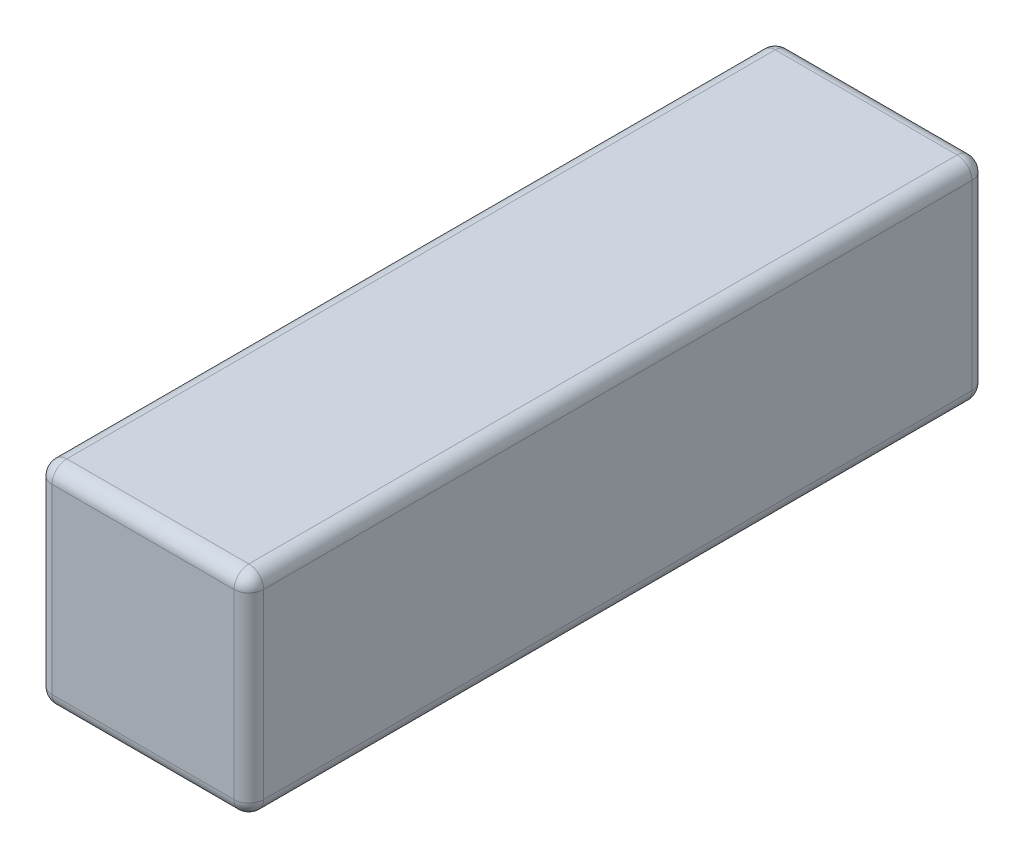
ISO-10303-21;
HEADER;
FILE_DESCRIPTION(('STEP AP214'),'2;1');
FILE_NAME('part.step','',(''),(''),'','','');
FILE_SCHEMA(('AUTOMOTIVE_DESIGN { 1 0 10303 214 1 1 1 1 }'));
ENDSEC;
DATA;
#1=APPLICATION_CONTEXT('core data for automotive mechanical design processes');
#2=APPLICATION_PROTOCOL_DEFINITION('international standard','automotive_design',2000,#1);
#3=PRODUCT_CONTEXT('',#1,'mechanical');
#4=PRODUCT('Part','Part','',(#3));
#5=PRODUCT_RELATED_PRODUCT_CATEGORY('part','',(#4));
#6=PRODUCT_DEFINITION_FORMATION('','',#4);
#7=PRODUCT_DEFINITION_CONTEXT('part definition',#1,'design');
#8=PRODUCT_DEFINITION('design','',#6,#7);
#9=PRODUCT_DEFINITION_SHAPE('','',#8);
#10=(LENGTH_UNIT() NAMED_UNIT(*) SI_UNIT(.MILLI.,.METRE.));
#11=(NAMED_UNIT(*) PLANE_ANGLE_UNIT() SI_UNIT($,.RADIAN.));
#12=(NAMED_UNIT(*) SI_UNIT($,.STERADIAN.) SOLID_ANGLE_UNIT());
#13=UNCERTAINTY_MEASURE_WITH_UNIT(LENGTH_MEASURE(1.E-05),#10,'distance_accuracy_value','');
#14=(GEOMETRIC_REPRESENTATION_CONTEXT(3) GLOBAL_UNCERTAINTY_ASSIGNED_CONTEXT((#13)) GLOBAL_UNIT_ASSIGNED_CONTEXT((#10,
#11,#12)) REPRESENTATION_CONTEXT('',''));
#15=CARTESIAN_POINT('',(0.,0.,0.));
#16=DIRECTION('',(0.,0.,1.));
#17=DIRECTION('',(1.,0.,0.));
#18=AXIS2_PLACEMENT_3D('',#15,#16,#17);
#19=CARTESIAN_POINT('',(-18.5,21.5,72.));
#20=DIRECTION('',(0.,-1.,0.));
#21=DIRECTION('',(0.,0.,-1.));
#22=AXIS2_PLACEMENT_3D('',#19,#20,#21);
#23=CYLINDRICAL_SURFACE('',#22,3.);
#24=DIRECTION('',(0.,-1.,0.));
#25=VECTOR('',#24,1.);
#26=CARTESIAN_POINT('',(-21.5,21.5,72.));
#27=LINE('',#26,#25);
#28=CARTESIAN_POINT('',(-21.5,18.5,72.));
#29=VERTEX_POINT('',#28);
#30=CARTESIAN_POINT('',(-21.5,-18.5,72.));
#31=VERTEX_POINT('',#30);
#32=EDGE_CURVE('E241',#29,#31,#27,.T.);
#33=ORIENTED_EDGE('',*,*,#32,.T.);
#34=CARTESIAN_POINT('',(-18.5,-18.5,72.));
#35=DIRECTION('',(0.,-1.,0.));
#36=DIRECTION('',(0.,0.,-1.));
#37=AXIS2_PLACEMENT_3D('',#34,#35,#36);
#38=CIRCLE('',#37,3.);
#39=CARTESIAN_POINT('',(-18.5,-18.5,75.));
#40=VERTEX_POINT('',#39);
#41=EDGE_CURVE('E296',#31,#40,#38,.F.);
#42=ORIENTED_EDGE('',*,*,#41,.T.);
#43=DIRECTION('',(0.,-1.,0.));
#44=VECTOR('',#43,1.);
#45=CARTESIAN_POINT('',(-18.5,21.5,75.));
#46=LINE('',#45,#44);
#47=CARTESIAN_POINT('',(-18.5,18.5,75.));
#48=VERTEX_POINT('',#47);
#49=EDGE_CURVE('E170',#48,#40,#46,.T.);
#50=ORIENTED_EDGE('',*,*,#49,.F.);
#51=CARTESIAN_POINT('',(-18.5,18.5,72.));
#52=DIRECTION('',(0.,-1.,0.));
#53=DIRECTION('',(0.,0.,-1.));
#54=AXIS2_PLACEMENT_3D('',#51,#52,#53);
#55=CIRCLE('',#54,3.);
#56=EDGE_CURVE('E293',#48,#29,#55,.T.);
#57=ORIENTED_EDGE('',*,*,#56,.T.);
#58=EDGE_LOOP('',(#33,#42,#50,#57));
#59=FACE_BOUND('',#58,.T.);
#60=ADVANCED_FACE('F46',(#59),#23,.T.);
#61=CARTESIAN_POINT('',(-18.5,21.5,75.));
#62=DIRECTION('',(0.,0.,-1.));
#63=DIRECTION('',(-1.,0.,0.));
#64=AXIS2_PLACEMENT_3D('',#61,#62,#63);
#65=PLANE('',#64);
#66=ORIENTED_EDGE('',*,*,#49,.T.);
#67=DIRECTION('',(1.,0.,0.));
#68=VECTOR('',#67,1.);
#69=CARTESIAN_POINT('',(-18.5,-18.5,75.));
#70=LINE('',#69,#68);
#71=CARTESIAN_POINT('',(18.5,-18.5,75.));
#72=VERTEX_POINT('',#71);
#73=EDGE_CURVE('E277',#40,#72,#70,.T.);
#74=ORIENTED_EDGE('',*,*,#73,.T.);
#75=DIRECTION('',(0.,-1.,0.));
#76=VECTOR('',#75,1.);
#77=CARTESIAN_POINT('',(18.5,21.5,75.));
#78=LINE('',#77,#76);
#79=CARTESIAN_POINT('',(18.5,18.5,75.));
#80=VERTEX_POINT('',#79);
#81=EDGE_CURVE('E161',#80,#72,#78,.T.);
#82=ORIENTED_EDGE('',*,*,#81,.F.);
#83=DIRECTION('',(1.,0.,0.));
#84=VECTOR('',#83,1.);
#85=CARTESIAN_POINT('',(-18.5,18.5,75.));
#86=LINE('',#85,#84);
#87=EDGE_CURVE('E274',#80,#48,#86,.F.);
#88=ORIENTED_EDGE('',*,*,#87,.T.);
#89=EDGE_LOOP('',(#66,#74,#82,#88));
#90=FACE_BOUND('',#89,.T.);
#91=ADVANCED_FACE('F337',(#90),#65,.F.);
#92=CARTESIAN_POINT('',(18.5,21.5,72.));
#93=DIRECTION('',(0.,-1.,0.));
#94=DIRECTION('',(0.,0.,-1.));
#95=AXIS2_PLACEMENT_3D('',#92,#93,#94);
#96=CYLINDRICAL_SURFACE('',#95,3.);
#97=ORIENTED_EDGE('',*,*,#81,.T.);
#98=CARTESIAN_POINT('',(18.5,-18.5,72.));
#99=DIRECTION('',(0.,-1.,0.));
#100=DIRECTION('',(0.,0.,-1.));
#101=AXIS2_PLACEMENT_3D('',#98,#99,#100);
#102=CIRCLE('',#101,3.);
#103=CARTESIAN_POINT('',(21.5,-18.5,72.));
#104=VERTEX_POINT('',#103);
#105=EDGE_CURVE('E159',#72,#104,#102,.F.);
#106=ORIENTED_EDGE('',*,*,#105,.T.);
#107=DIRECTION('',(0.,-1.,0.));
#108=VECTOR('',#107,1.);
#109=CARTESIAN_POINT('',(21.5,21.5,72.));
#110=LINE('',#109,#108);
#111=CARTESIAN_POINT('',(21.5,18.5,72.));
#112=VERTEX_POINT('',#111);
#113=EDGE_CURVE('E140',#112,#104,#110,.T.);
#114=ORIENTED_EDGE('',*,*,#113,.F.);
#115=CARTESIAN_POINT('',(18.5,18.5,72.));
#116=DIRECTION('',(0.,-1.,0.));
#117=DIRECTION('',(0.,0.,-1.));
#118=AXIS2_PLACEMENT_3D('',#115,#116,#117);
#119=CIRCLE('',#118,3.);
#120=EDGE_CURVE('E156',#112,#80,#119,.T.);
#121=ORIENTED_EDGE('',*,*,#120,.T.);
#122=EDGE_LOOP('',(#97,#106,#114,#121));
#123=FACE_BOUND('',#122,.T.);
#124=ADVANCED_FACE('F155',(#123),#96,.T.);
#125=CARTESIAN_POINT('',(21.5,21.5,72.));
#126=DIRECTION('',(-1.,0.,0.));
#127=DIRECTION('',(0.,0.,1.));
#128=AXIS2_PLACEMENT_3D('',#125,#126,#127);
#129=PLANE('',#128);
#130=ORIENTED_EDGE('',*,*,#113,.T.);
#131=DIRECTION('',(0.,0.,-1.));
#132=VECTOR('',#131,1.);
#133=CARTESIAN_POINT('',(21.5,-18.5,72.));
#134=LINE('',#133,#132);
#135=CARTESIAN_POINT('',(21.5,-18.5,-72.));
#136=VERTEX_POINT('',#135);
#137=EDGE_CURVE('E11',#104,#136,#134,.T.);
#138=ORIENTED_EDGE('',*,*,#137,.T.);
#139=DIRECTION('',(0.,-1.,0.));
#140=VECTOR('',#139,1.);
#141=CARTESIAN_POINT('',(21.5,21.5,-72.));
#142=LINE('',#141,#140);
#143=CARTESIAN_POINT('',(21.5,18.5,-72.));
#144=VERTEX_POINT('',#143);
#145=EDGE_CURVE('E142',#144,#136,#142,.T.);
#146=ORIENTED_EDGE('',*,*,#145,.F.);
#147=DIRECTION('',(0.,0.,-1.));
#148=VECTOR('',#147,1.);
#149=CARTESIAN_POINT('',(21.5,18.5,72.));
#150=LINE('',#149,#148);
#151=EDGE_CURVE('E56',#144,#112,#150,.F.);
#152=ORIENTED_EDGE('',*,*,#151,.T.);
#153=EDGE_LOOP('',(#130,#138,#146,#152));
#154=FACE_BOUND('',#153,.T.);
#155=ADVANCED_FACE('F139',(#154),#129,.F.);
#156=CARTESIAN_POINT('',(18.5,21.5,-72.));
#157=DIRECTION('',(0.,-1.,0.));
#158=DIRECTION('',(0.,0.,-1.));
#159=AXIS2_PLACEMENT_3D('',#156,#157,#158);
#160=CYLINDRICAL_SURFACE('',#159,3.);
#161=ORIENTED_EDGE('',*,*,#145,.T.);
#162=CARTESIAN_POINT('',(18.5,-18.5,-72.));
#163=DIRECTION('',(0.,-1.,0.));
#164=DIRECTION('',(0.,0.,-1.));
#165=AXIS2_PLACEMENT_3D('',#162,#163,#164);
#166=CIRCLE('',#165,3.);
#167=CARTESIAN_POINT('',(18.5,-18.5,-75.));
#168=VERTEX_POINT('',#167);
#169=EDGE_CURVE('E320',#136,#168,#166,.F.);
#170=ORIENTED_EDGE('',*,*,#169,.T.);
#171=DIRECTION('',(0.,-1.,0.));
#172=VECTOR('',#171,1.);
#173=CARTESIAN_POINT('',(18.5,21.5,-75.));
#174=LINE('',#173,#172);
#175=CARTESIAN_POINT('',(18.5,18.5,-75.));
#176=VERTEX_POINT('',#175);
#177=EDGE_CURVE('E261',#176,#168,#174,.T.);
#178=ORIENTED_EDGE('',*,*,#177,.F.);
#179=CARTESIAN_POINT('',(18.5,18.5,-72.));
#180=DIRECTION('',(0.,-1.,0.));
#181=DIRECTION('',(0.,0.,-1.));
#182=AXIS2_PLACEMENT_3D('',#179,#180,#181);
#183=CIRCLE('',#182,3.);
#184=EDGE_CURVE('E317',#176,#144,#183,.T.);
#185=ORIENTED_EDGE('',*,*,#184,.T.);
#186=EDGE_LOOP('',(#161,#170,#178,#185));
#187=FACE_BOUND('',#186,.T.);
#188=ADVANCED_FACE('F360',(#187),#160,.T.);
#189=CARTESIAN_POINT('',(-18.5,21.5,-75.));
#190=DIRECTION('',(0.,0.,1.));
#191=DIRECTION('',(1.,0.,0.));
#192=AXIS2_PLACEMENT_3D('',#189,#190,#191);
#193=PLANE('',#192);
#194=ORIENTED_EDGE('',*,*,#177,.T.);
#195=DIRECTION('',(-1.,0.,0.));
#196=VECTOR('',#195,1.);
#197=CARTESIAN_POINT('',(-18.5,-18.5,-75.));
#198=LINE('',#197,#196);
#199=CARTESIAN_POINT('',(-18.5,-18.5,-75.));
#200=VERTEX_POINT('',#199);
#201=EDGE_CURVE('E314',#168,#200,#198,.T.);
#202=ORIENTED_EDGE('',*,*,#201,.T.);
#203=DIRECTION('',(0.,-1.,0.));
#204=VECTOR('',#203,1.);
#205=CARTESIAN_POINT('',(-18.5,21.5,-75.));
#206=LINE('',#205,#204);
#207=CARTESIAN_POINT('',(-18.5,18.5,-75.));
#208=VERTEX_POINT('',#207);
#209=EDGE_CURVE('E255',#208,#200,#206,.T.);
#210=ORIENTED_EDGE('',*,*,#209,.F.);
#211=DIRECTION('',(-1.,0.,0.));
#212=VECTOR('',#211,1.);
#213=CARTESIAN_POINT('',(18.5,18.5,-75.));
#214=LINE('',#213,#212);
#215=EDGE_CURVE('E311',#208,#176,#214,.F.);
#216=ORIENTED_EDGE('',*,*,#215,.T.);
#217=EDGE_LOOP('',(#194,#202,#210,#216));
#218=FACE_BOUND('',#217,.T.);
#219=ADVANCED_FACE('F358',(#218),#193,.F.);
#220=CARTESIAN_POINT('',(-18.5,21.5,-72.));
#221=DIRECTION('',(0.,-1.,0.));
#222=DIRECTION('',(0.,0.,-1.));
#223=AXIS2_PLACEMENT_3D('',#220,#221,#222);
#224=CYLINDRICAL_SURFACE('',#223,3.);
#225=ORIENTED_EDGE('',*,*,#209,.T.);
#226=CARTESIAN_POINT('',(-18.5,-18.5,-72.));
#227=DIRECTION('',(0.,-1.,0.));
#228=DIRECTION('',(0.,0.,-1.));
#229=AXIS2_PLACEMENT_3D('',#226,#227,#228);
#230=CIRCLE('',#229,3.);
#231=CARTESIAN_POINT('',(-21.5,-18.5,-72.));
#232=VERTEX_POINT('',#231);
#233=EDGE_CURVE('E308',#200,#232,#230,.F.);
#234=ORIENTED_EDGE('',*,*,#233,.T.);
#235=DIRECTION('',(0.,-1.,0.));
#236=VECTOR('',#235,1.);
#237=CARTESIAN_POINT('',(-21.5,21.5,-72.));
#238=LINE('',#237,#236);
#239=CARTESIAN_POINT('',(-21.5,18.5,-72.));
#240=VERTEX_POINT('',#239);
#241=EDGE_CURVE('E248',#240,#232,#238,.T.);
#242=ORIENTED_EDGE('',*,*,#241,.F.);
#243=CARTESIAN_POINT('',(-18.5,18.5,-72.));
#244=DIRECTION('',(0.,-1.,0.));
#245=DIRECTION('',(0.,0.,-1.));
#246=AXIS2_PLACEMENT_3D('',#243,#244,#245);
#247=CIRCLE('',#246,3.);
#248=EDGE_CURVE('E305',#240,#208,#247,.T.);
#249=ORIENTED_EDGE('',*,*,#248,.T.);
#250=EDGE_LOOP('',(#225,#234,#242,#249));
#251=FACE_BOUND('',#250,.T.);
#252=ADVANCED_FACE('F349',(#251),#224,.T.);
#253=CARTESIAN_POINT('',(-21.5,21.5,72.));
#254=DIRECTION('',(1.,0.,0.));
#255=DIRECTION('',(0.,0.,-1.));
#256=AXIS2_PLACEMENT_3D('',#253,#254,#255);
#257=PLANE('',#256);
#258=ORIENTED_EDGE('',*,*,#241,.T.);
#259=DIRECTION('',(0.,0.,1.));
#260=VECTOR('',#259,1.);
#261=CARTESIAN_POINT('',(-21.5,-18.5,72.));
#262=LINE('',#261,#260);
#263=EDGE_CURVE('E302',#232,#31,#262,.T.);
#264=ORIENTED_EDGE('',*,*,#263,.T.);
#265=ORIENTED_EDGE('',*,*,#32,.F.);
#266=DIRECTION('',(0.,0.,1.));
#267=VECTOR('',#266,1.);
#268=CARTESIAN_POINT('',(-21.5,18.5,-72.));
#269=LINE('',#268,#267);
#270=EDGE_CURVE('E299',#29,#240,#269,.F.);
#271=ORIENTED_EDGE('',*,*,#270,.T.);
#272=EDGE_LOOP('',(#258,#264,#265,#271));
#273=FACE_BOUND('',#272,.T.);
#274=ADVANCED_FACE('F346',(#273),#257,.F.);
#275=CARTESIAN_POINT('',(-18.5,21.5,72.));
#276=DIRECTION('',(0.,1.,0.));
#277=DIRECTION('',(0.,0.,1.));
#278=AXIS2_PLACEMENT_3D('',#275,#276,#277);
#279=PLANE('',#278);
#280=DIRECTION('',(0.,0.,1.));
#281=VECTOR('',#280,1.);
#282=CARTESIAN_POINT('',(-18.5,21.5,72.));
#283=LINE('',#282,#281);
#284=CARTESIAN_POINT('',(-18.5,21.5,-72.));
#285=VERTEX_POINT('',#284);
#286=CARTESIAN_POINT('',(-18.5,21.5,72.));
#287=VERTEX_POINT('',#286);
#288=EDGE_CURVE('E64',#285,#287,#283,.T.);
#289=ORIENTED_EDGE('',*,*,#288,.T.);
#290=DIRECTION('',(1.,0.,0.));
#291=VECTOR('',#290,1.);
#292=CARTESIAN_POINT('',(18.5,21.5,72.));
#293=LINE('',#292,#291);
#294=CARTESIAN_POINT('',(18.5,21.5,72.));
#295=VERTEX_POINT('',#294);
#296=EDGE_CURVE('E148',#287,#295,#293,.T.);
#297=ORIENTED_EDGE('',*,*,#296,.T.);
#298=DIRECTION('',(0.,0.,-1.));
#299=VECTOR('',#298,1.);
#300=CARTESIAN_POINT('',(18.5,21.5,-72.));
#301=LINE('',#300,#299);
#302=CARTESIAN_POINT('',(18.5,21.5,-72.));
#303=VERTEX_POINT('',#302);
#304=EDGE_CURVE('E174',#295,#303,#301,.T.);
#305=ORIENTED_EDGE('',*,*,#304,.T.);
#306=DIRECTION('',(-1.,0.,0.));
#307=VECTOR('',#306,1.);
#308=CARTESIAN_POINT('',(-18.5,21.5,-72.));
#309=LINE('',#308,#307);
#310=EDGE_CURVE('E69',#303,#285,#309,.T.);
#311=ORIENTED_EDGE('',*,*,#310,.T.);
#312=EDGE_LOOP('',(#289,#297,#305,#311));
#313=FACE_BOUND('',#312,.T.);
#314=ADVANCED_FACE('F331',(#313),#279,.T.);
#315=CARTESIAN_POINT('',(-18.5,-21.5,72.));
#316=DIRECTION('',(0.,1.,0.));
#317=DIRECTION('',(0.,0.,1.));
#318=AXIS2_PLACEMENT_3D('',#315,#316,#317);
#319=PLANE('',#318);
#320=DIRECTION('',(0.,0.,-1.));
#321=VECTOR('',#320,1.);
#322=CARTESIAN_POINT('',(18.5,-21.5,72.));
#323=LINE('',#322,#321);
#324=CARTESIAN_POINT('',(18.5,-21.5,-72.));
#325=VERTEX_POINT('',#324);
#326=CARTESIAN_POINT('',(18.5,-21.5,72.));
#327=VERTEX_POINT('',#326);
#328=EDGE_CURVE('E280',#325,#327,#323,.F.);
#329=ORIENTED_EDGE('',*,*,#328,.T.);
#330=DIRECTION('',(1.,0.,0.));
#331=VECTOR('',#330,1.);
#332=CARTESIAN_POINT('',(-18.5,-21.5,72.));
#333=LINE('',#332,#331);
#334=CARTESIAN_POINT('',(-18.5,-21.5,72.));
#335=VERTEX_POINT('',#334);
#336=EDGE_CURVE('E289',#327,#335,#333,.F.);
#337=ORIENTED_EDGE('',*,*,#336,.T.);
#338=DIRECTION('',(0.,0.,1.));
#339=VECTOR('',#338,1.);
#340=CARTESIAN_POINT('',(-18.5,-21.5,72.));
#341=LINE('',#340,#339);
#342=CARTESIAN_POINT('',(-18.5,-21.5,-72.));
#343=VERTEX_POINT('',#342);
#344=EDGE_CURVE('E286',#335,#343,#341,.F.);
#345=ORIENTED_EDGE('',*,*,#344,.T.);
#346=DIRECTION('',(-1.,0.,0.));
#347=VECTOR('',#346,1.);
#348=CARTESIAN_POINT('',(-18.5,-21.5,-72.));
#349=LINE('',#348,#347);
#350=EDGE_CURVE('E283',#343,#325,#349,.F.);
#351=ORIENTED_EDGE('',*,*,#350,.T.);
#352=EDGE_LOOP('',(#329,#337,#345,#351));
#353=FACE_BOUND('',#352,.T.);
#354=ADVANCED_FACE('F371',(#353),#319,.F.);
#355=CARTESIAN_POINT('',(-18.5,-18.5,-72.));
#356=DIRECTION('',(0.,1.,0.));
#357=DIRECTION('',(0.,0.,1.));
#358=AXIS2_PLACEMENT_3D('',#355,#356,#357);
#359=SPHERICAL_SURFACE('',#358,3.);
#360=CARTESIAN_POINT('',(-18.5,-18.5,-72.));
#361=DIRECTION('',(1.,0.,0.));
#362=DIRECTION('',(0.,0.,-1.));
#363=AXIS2_PLACEMENT_3D('',#360,#361,#362);
#364=CIRCLE('',#363,3.);
#365=EDGE_CURVE('E232',#343,#200,#364,.T.);
#366=ORIENTED_EDGE('',*,*,#365,.F.);
#367=CARTESIAN_POINT('',(-18.5,-18.5,-72.));
#368=DIRECTION('',(0.,0.,1.));
#369=DIRECTION('',(1.,0.,0.));
#370=AXIS2_PLACEMENT_3D('',#367,#368,#369);
#371=CIRCLE('',#370,3.);
#372=EDGE_CURVE('E181',#232,#343,#371,.T.);
#373=ORIENTED_EDGE('',*,*,#372,.F.);
#374=ORIENTED_EDGE('',*,*,#233,.F.);
#375=EDGE_LOOP('',(#366,#373,#374));
#376=FACE_BOUND('',#375,.T.);
#377=ADVANCED_FACE('F405',(#376),#359,.T.);
#378=CARTESIAN_POINT('',(-18.5,-18.5,72.));
#379=DIRECTION('',(0.,0.,1.));
#380=DIRECTION('',(1.,0.,0.));
#381=AXIS2_PLACEMENT_3D('',#378,#379,#380);
#382=CYLINDRICAL_SURFACE('',#381,3.);
#383=ORIENTED_EDGE('',*,*,#372,.T.);
#384=ORIENTED_EDGE('',*,*,#344,.F.);
#385=CARTESIAN_POINT('',(-18.5,-18.5,72.));
#386=DIRECTION('',(0.,0.,1.));
#387=DIRECTION('',(1.,0.,0.));
#388=AXIS2_PLACEMENT_3D('',#385,#386,#387);
#389=CIRCLE('',#388,3.);
#390=EDGE_CURVE('E229',#31,#335,#389,.T.);
#391=ORIENTED_EDGE('',*,*,#390,.F.);
#392=ORIENTED_EDGE('',*,*,#263,.F.);
#393=EDGE_LOOP('',(#383,#384,#391,#392));
#394=FACE_BOUND('',#393,.T.);
#395=ADVANCED_FACE('F421',(#394),#382,.T.);
#396=CARTESIAN_POINT('',(-18.5,-18.5,-72.));
#397=DIRECTION('',(-1.,0.,0.));
#398=DIRECTION('',(0.,0.,1.));
#399=AXIS2_PLACEMENT_3D('',#396,#397,#398);
#400=CYLINDRICAL_SURFACE('',#399,3.);
#401=ORIENTED_EDGE('',*,*,#365,.T.);
#402=ORIENTED_EDGE('',*,*,#201,.F.);
#403=CARTESIAN_POINT('',(18.5,-18.5,-72.));
#404=DIRECTION('',(1.,0.,0.));
#405=DIRECTION('',(0.,0.,-1.));
#406=AXIS2_PLACEMENT_3D('',#403,#404,#405);
#407=CIRCLE('',#406,3.);
#408=EDGE_CURVE('E225',#325,#168,#407,.T.);
#409=ORIENTED_EDGE('',*,*,#408,.F.);
#410=ORIENTED_EDGE('',*,*,#350,.F.);
#411=EDGE_LOOP('',(#401,#402,#409,#410));
#412=FACE_BOUND('',#411,.T.);
#413=ADVANCED_FACE('F429',(#412),#400,.T.);
#414=CARTESIAN_POINT('',(-18.5,-18.5,72.));
#415=DIRECTION('',(0.,1.,0.));
#416=DIRECTION('',(0.,0.,1.));
#417=AXIS2_PLACEMENT_3D('',#414,#415,#416);
#418=SPHERICAL_SURFACE('',#417,3.);
#419=ORIENTED_EDGE('',*,*,#41,.F.);
#420=ORIENTED_EDGE('',*,*,#390,.T.);
#421=CARTESIAN_POINT('',(-18.5,-18.5,72.));
#422=DIRECTION('',(1.,0.,0.));
#423=DIRECTION('',(0.,0.,-1.));
#424=AXIS2_PLACEMENT_3D('',#421,#422,#423);
#425=CIRCLE('',#424,3.);
#426=EDGE_CURVE('E222',#40,#335,#425,.T.);
#427=ORIENTED_EDGE('',*,*,#426,.F.);
#428=EDGE_LOOP('',(#419,#420,#427));
#429=FACE_BOUND('',#428,.T.);
#430=ADVANCED_FACE('F436',(#429),#418,.T.);
#431=CARTESIAN_POINT('',(18.5,-18.5,-72.));
#432=DIRECTION('',(0.,1.,0.));
#433=DIRECTION('',(0.,0.,1.));
#434=AXIS2_PLACEMENT_3D('',#431,#432,#433);
#435=SPHERICAL_SURFACE('',#434,3.);
#436=ORIENTED_EDGE('',*,*,#408,.T.);
#437=ORIENTED_EDGE('',*,*,#169,.F.);
#438=CARTESIAN_POINT('',(18.5,-18.5,-72.));
#439=DIRECTION('',(0.,0.,1.));
#440=DIRECTION('',(1.,0.,0.));
#441=AXIS2_PLACEMENT_3D('',#438,#439,#440);
#442=CIRCLE('',#441,3.);
#443=EDGE_CURVE('E216',#325,#136,#442,.T.);
#444=ORIENTED_EDGE('',*,*,#443,.F.);
#445=EDGE_LOOP('',(#436,#437,#444));
#446=FACE_BOUND('',#445,.T.);
#447=ADVANCED_FACE('F364',(#446),#435,.T.);
#448=CARTESIAN_POINT('',(-18.5,-18.5,72.));
#449=DIRECTION('',(1.,0.,0.));
#450=DIRECTION('',(0.,0.,-1.));
#451=AXIS2_PLACEMENT_3D('',#448,#449,#450);
#452=CYLINDRICAL_SURFACE('',#451,3.);
#453=ORIENTED_EDGE('',*,*,#426,.T.);
#454=ORIENTED_EDGE('',*,*,#336,.F.);
#455=CARTESIAN_POINT('',(18.5,-18.5,72.));
#456=DIRECTION('',(1.,0.,0.));
#457=DIRECTION('',(0.,0.,-1.));
#458=AXIS2_PLACEMENT_3D('',#455,#456,#457);
#459=CIRCLE('',#458,3.);
#460=EDGE_CURVE('E209',#72,#327,#459,.T.);
#461=ORIENTED_EDGE('',*,*,#460,.F.);
#462=ORIENTED_EDGE('',*,*,#73,.F.);
#463=EDGE_LOOP('',(#453,#454,#461,#462));
#464=FACE_BOUND('',#463,.T.);
#465=ADVANCED_FACE('F374',(#464),#452,.T.);
#466=CARTESIAN_POINT('',(18.5,-18.5,72.));
#467=DIRECTION('',(0.,0.,-1.));
#468=DIRECTION('',(-1.,0.,0.));
#469=AXIS2_PLACEMENT_3D('',#466,#467,#468);
#470=CYLINDRICAL_SURFACE('',#469,3.);
#471=ORIENTED_EDGE('',*,*,#443,.T.);
#472=ORIENTED_EDGE('',*,*,#137,.F.);
#473=CARTESIAN_POINT('',(18.5,-18.5,72.));
#474=DIRECTION('',(0.,0.,1.));
#475=DIRECTION('',(1.,0.,0.));
#476=AXIS2_PLACEMENT_3D('',#473,#474,#475);
#477=CIRCLE('',#476,3.);
#478=EDGE_CURVE('E205',#327,#104,#477,.T.);
#479=ORIENTED_EDGE('',*,*,#478,.F.);
#480=ORIENTED_EDGE('',*,*,#328,.F.);
#481=EDGE_LOOP('',(#471,#472,#479,#480));
#482=FACE_BOUND('',#481,.T.);
#483=ADVANCED_FACE('F368',(#482),#470,.T.);
#484=CARTESIAN_POINT('',(18.5,-18.5,72.));
#485=DIRECTION('',(0.,1.,0.));
#486=DIRECTION('',(0.,0.,1.));
#487=AXIS2_PLACEMENT_3D('',#484,#485,#486);
#488=SPHERICAL_SURFACE('',#487,3.);
#489=ORIENTED_EDGE('',*,*,#105,.F.);
#490=ORIENTED_EDGE('',*,*,#460,.T.);
#491=ORIENTED_EDGE('',*,*,#478,.T.);
#492=EDGE_LOOP('',(#489,#490,#491));
#493=FACE_BOUND('',#492,.T.);
#494=ADVANCED_FACE('F376',(#493),#488,.T.);
#495=CARTESIAN_POINT('',(-18.5,18.5,-72.));
#496=DIRECTION('',(0.,1.,0.));
#497=DIRECTION('',(0.,0.,1.));
#498=AXIS2_PLACEMENT_3D('',#495,#496,#497);
#499=SPHERICAL_SURFACE('',#498,3.);
#500=CARTESIAN_POINT('',(-18.5,18.5,-72.));
#501=DIRECTION('',(1.,0.,0.));
#502=DIRECTION('',(0.,0.,-1.));
#503=AXIS2_PLACEMENT_3D('',#500,#501,#502);
#504=CIRCLE('',#503,3.);
#505=EDGE_CURVE('E197',#208,#285,#504,.T.);
#506=ORIENTED_EDGE('',*,*,#505,.F.);
#507=ORIENTED_EDGE('',*,*,#248,.F.);
#508=CARTESIAN_POINT('',(-18.5,18.5,-72.));
#509=DIRECTION('',(0.,0.,1.));
#510=DIRECTION('',(1.,0.,0.));
#511=AXIS2_PLACEMENT_3D('',#508,#509,#510);
#512=CIRCLE('',#511,3.);
#513=EDGE_CURVE('E50',#285,#240,#512,.T.);
#514=ORIENTED_EDGE('',*,*,#513,.F.);
#515=EDGE_LOOP('',(#506,#507,#514));
#516=FACE_BOUND('',#515,.T.);
#517=ADVANCED_FACE('F48',(#516),#499,.T.);
#518=CARTESIAN_POINT('',(-18.5,18.5,72.));
#519=DIRECTION('',(0.,0.,-1.));
#520=DIRECTION('',(-1.,0.,0.));
#521=AXIS2_PLACEMENT_3D('',#518,#519,#520);
#522=CYLINDRICAL_SURFACE('',#521,3.);
#523=ORIENTED_EDGE('',*,*,#513,.T.);
#524=ORIENTED_EDGE('',*,*,#270,.F.);
#525=CARTESIAN_POINT('',(-18.5,18.5,72.));
#526=DIRECTION('',(0.,0.,1.));
#527=DIRECTION('',(1.,0.,0.));
#528=AXIS2_PLACEMENT_3D('',#525,#526,#527);
#529=CIRCLE('',#528,3.);
#530=EDGE_CURVE('E194',#287,#29,#529,.T.);
#531=ORIENTED_EDGE('',*,*,#530,.F.);
#532=ORIENTED_EDGE('',*,*,#288,.F.);
#533=EDGE_LOOP('',(#523,#524,#531,#532));
#534=FACE_BOUND('',#533,.T.);
#535=ADVANCED_FACE('F343',(#534),#522,.T.);
#536=CARTESIAN_POINT('',(-18.5,18.5,-72.));
#537=DIRECTION('',(1.,0.,0.));
#538=DIRECTION('',(0.,0.,-1.));
#539=AXIS2_PLACEMENT_3D('',#536,#537,#538);
#540=CYLINDRICAL_SURFACE('',#539,3.);
#541=ORIENTED_EDGE('',*,*,#505,.T.);
#542=ORIENTED_EDGE('',*,*,#310,.F.);
#543=CARTESIAN_POINT('',(18.5,18.5,-72.));
#544=DIRECTION('',(1.,0.,0.));
#545=DIRECTION('',(0.,0.,-1.));
#546=AXIS2_PLACEMENT_3D('',#543,#544,#545);
#547=CIRCLE('',#546,3.);
#548=EDGE_CURVE('E190',#176,#303,#547,.T.);
#549=ORIENTED_EDGE('',*,*,#548,.F.);
#550=ORIENTED_EDGE('',*,*,#215,.F.);
#551=EDGE_LOOP('',(#541,#542,#549,#550));
#552=FACE_BOUND('',#551,.T.);
#553=ADVANCED_FACE('F354',(#552),#540,.T.);
#554=CARTESIAN_POINT('',(-18.5,18.5,72.));
#555=DIRECTION('',(0.,1.,0.));
#556=DIRECTION('',(0.,0.,1.));
#557=AXIS2_PLACEMENT_3D('',#554,#555,#556);
#558=SPHERICAL_SURFACE('',#557,3.);
#559=ORIENTED_EDGE('',*,*,#530,.T.);
#560=ORIENTED_EDGE('',*,*,#56,.F.);
#561=CARTESIAN_POINT('',(-18.5,18.5,72.));
#562=DIRECTION('',(1.,0.,0.));
#563=DIRECTION('',(0.,0.,-1.));
#564=AXIS2_PLACEMENT_3D('',#561,#562,#563);
#565=CIRCLE('',#564,3.);
#566=EDGE_CURVE('E186',#287,#48,#565,.T.);
#567=ORIENTED_EDGE('',*,*,#566,.F.);
#568=EDGE_LOOP('',(#559,#560,#567));
#569=FACE_BOUND('',#568,.T.);
#570=ADVANCED_FACE('F342',(#569),#558,.T.);
#571=CARTESIAN_POINT('',(18.5,18.5,-72.));
#572=DIRECTION('',(0.,1.,0.));
#573=DIRECTION('',(0.,0.,1.));
#574=AXIS2_PLACEMENT_3D('',#571,#572,#573);
#575=SPHERICAL_SURFACE('',#574,3.);
#576=ORIENTED_EDGE('',*,*,#184,.F.);
#577=ORIENTED_EDGE('',*,*,#548,.T.);
#578=CARTESIAN_POINT('',(18.5,18.5,-72.));
#579=DIRECTION('',(0.,0.,1.));
#580=DIRECTION('',(1.,0.,0.));
#581=AXIS2_PLACEMENT_3D('',#578,#579,#580);
#582=CIRCLE('',#581,3.);
#583=EDGE_CURVE('E178',#144,#303,#582,.T.);
#584=ORIENTED_EDGE('',*,*,#583,.F.);
#585=EDGE_LOOP('',(#576,#577,#584));
#586=FACE_BOUND('',#585,.T.);
#587=ADVANCED_FACE('F499',(#586),#575,.T.);
#588=CARTESIAN_POINT('',(-18.5,18.5,72.));
#589=DIRECTION('',(-1.,0.,0.));
#590=DIRECTION('',(0.,0.,1.));
#591=AXIS2_PLACEMENT_3D('',#588,#589,#590);
#592=CYLINDRICAL_SURFACE('',#591,3.);
#593=ORIENTED_EDGE('',*,*,#566,.T.);
#594=ORIENTED_EDGE('',*,*,#87,.F.);
#595=CARTESIAN_POINT('',(18.5,18.5,72.));
#596=DIRECTION('',(1.,0.,0.));
#597=DIRECTION('',(0.,0.,-1.));
#598=AXIS2_PLACEMENT_3D('',#595,#596,#597);
#599=CIRCLE('',#598,3.);
#600=EDGE_CURVE('E167',#295,#80,#599,.T.);
#601=ORIENTED_EDGE('',*,*,#600,.F.);
#602=ORIENTED_EDGE('',*,*,#296,.F.);
#603=EDGE_LOOP('',(#593,#594,#601,#602));
#604=FACE_BOUND('',#603,.T.);
#605=ADVANCED_FACE('F333',(#604),#592,.T.);
#606=CARTESIAN_POINT('',(18.5,18.5,72.));
#607=DIRECTION('',(0.,0.,1.));
#608=DIRECTION('',(1.,0.,0.));
#609=AXIS2_PLACEMENT_3D('',#606,#607,#608);
#610=CYLINDRICAL_SURFACE('',#609,3.);
#611=ORIENTED_EDGE('',*,*,#583,.T.);
#612=ORIENTED_EDGE('',*,*,#304,.F.);
#613=CARTESIAN_POINT('',(18.5,18.5,72.));
#614=DIRECTION('',(0.,0.,1.));
#615=DIRECTION('',(1.,0.,0.));
#616=AXIS2_PLACEMENT_3D('',#613,#614,#615);
#617=CIRCLE('',#616,3.);
#618=EDGE_CURVE('E165',#112,#295,#617,.T.);
#619=ORIENTED_EDGE('',*,*,#618,.F.);
#620=ORIENTED_EDGE('',*,*,#151,.F.);
#621=EDGE_LOOP('',(#611,#612,#619,#620));
#622=FACE_BOUND('',#621,.T.);
#623=ADVANCED_FACE('F173',(#622),#610,.T.);
#624=CARTESIAN_POINT('',(18.5,18.5,72.));
#625=DIRECTION('',(0.,1.,0.));
#626=DIRECTION('',(0.,0.,1.));
#627=AXIS2_PLACEMENT_3D('',#624,#625,#626);
#628=SPHERICAL_SURFACE('',#627,3.);
#629=ORIENTED_EDGE('',*,*,#600,.T.);
#630=ORIENTED_EDGE('',*,*,#120,.F.);
#631=ORIENTED_EDGE('',*,*,#618,.T.);
#632=EDGE_LOOP('',(#629,#630,#631));
#633=FACE_BOUND('',#632,.T.);
#634=ADVANCED_FACE('F164',(#633),#628,.T.);
#635=CLOSED_SHELL('',(#60,#91,#124,#155,#188,#219,#252,#274,#314,#354,#377,#395,#413,#430,#447,
#465,#483,#494,#517,#535,#553,#570,#587,#605,#623,#634));
#636=MANIFOLD_SOLID_BREP('B2',#635);
#637=ADVANCED_BREP_SHAPE_REPRESENTATION('',(#18,#636),#14);
#638=SHAPE_DEFINITION_REPRESENTATION(#9,#637);
ENDSEC;
END-ISO-10303-21;
